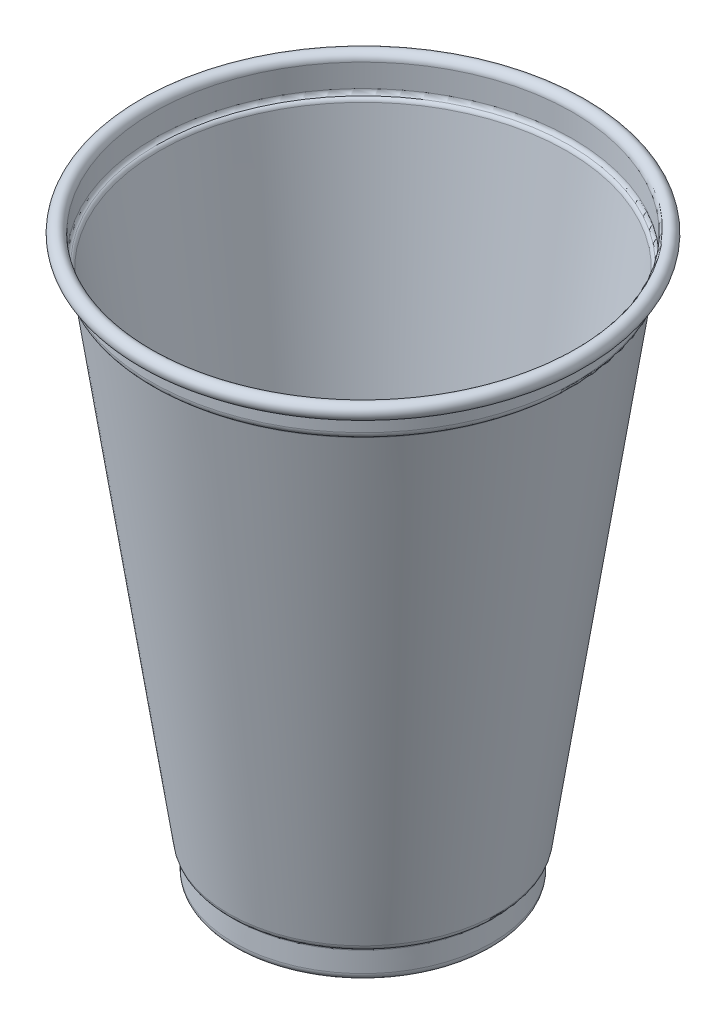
from build123d import *


with BuildPart() as part:
    # Sketch1 → Revolve2 (revolve)
    with BuildSketch(Plane.XY, mode=Mode.PRIVATE) as revolve2_sk:
        with BuildLine():
            Line((0, 0.85), (0, 0.35))
            Line((0, 0.35), (-17.680926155, 0.35))
            ThreePointArc((-17.680926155, 0.35), (-17.816649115, 0.331226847), (-17.942180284, 0.276317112))
            Line((-17.942180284, 0.276317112), (-18.848272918, -0.278951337))
            ThreePointArc((-18.848272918, -0.278951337), (-19.224866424, -0.44368054), (-19.632035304, -0.5))
            Line((-19.632035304, -0.5), (-26.12590707, -0.5))
            ThreePointArc((-26.12590707, -0.5), (-27.199116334, -0.047960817), (-27.62548208, 1.035704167))
            Line((-27.62548208, 1.035704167), (-27.524234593, 5.288098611))
            ThreePointArc((-27.524234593, 5.288098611), (-27.59951284, 5.564067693), (-27.813757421, 5.753606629))
            ThreePointArc((-27.813757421, 5.753606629), (-28.384890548, 6.217286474), (-28.666873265, 6.896755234))
            Line((-28.666873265, 6.896755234), (-44.048657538, 111.772557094))
            ThreePointArc((-44.048657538, 111.772557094), (-44.146616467, 112.004287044), (-44.345023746, 112.15897794))
            ThreePointArc((-44.345023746, 112.15897794), (-45.003502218, 112.712059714), (-45.25, 113.535911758))
            Line((-45.25, 113.535911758), (-45.25, 118.435222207))
            ThreePointArc((-45.25, 118.435222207), (-47.188446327, 118.984816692), (-45.826915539, 117.499602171))
            Line((-45.826915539, 117.499602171), (-45.600481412, 117.053809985))
            ThreePointArc((-45.600481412, 117.053809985), (-47.614602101, 119.246335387), (-44.75, 118.435222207))
            Line((-44.75, 118.435222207), (-44.75, 113.535911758))
            ThreePointArc((-44.75, 113.535911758), (-44.585668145, 112.986677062), (-44.146682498, 112.617955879))
            ThreePointArc((-44.146682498, 112.617955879), (-43.749867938, 112.308574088), (-43.553950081, 111.845114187))
            Line((-43.553950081, 111.845114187), (-28.172165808, 6.969312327))
            ThreePointArc((-28.172165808, 6.969312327), (-27.98417733, 6.516333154), (-27.603421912, 6.207213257))
            ThreePointArc((-27.603421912, 6.207213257), (-27.174932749, 5.828135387), (-27.024376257, 5.276197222))
            Line((-27.024376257, 5.276197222), (-27.125623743, 1.023802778))
            ThreePointArc((-27.125623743, 1.023802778), (-26.841379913, 0.301359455), (-26.12590707, 0))
            Line((-26.12590707, 0), (-19.632035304, 0))
            ThreePointArc((-19.632035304, 0), (-19.360589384, 0.037546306), (-19.109527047, 0.147365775))
            Line((-19.109527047, 0.147365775), (-18.203434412, 0.702634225))
            ThreePointArc((-18.203434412, 0.702634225), (-17.952372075, 0.812453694), (-17.680926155, 0.85))
            Line((-17.680926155, 0.85), (0, 0.85))
        make_face()
    revolve(revolve2_sk.sketch.rotate(Axis((0, 0, 0), (0, 1, 0)), 270), axis=Axis((0, 0, 0), (0, 1, 0)))


solid = part.part
